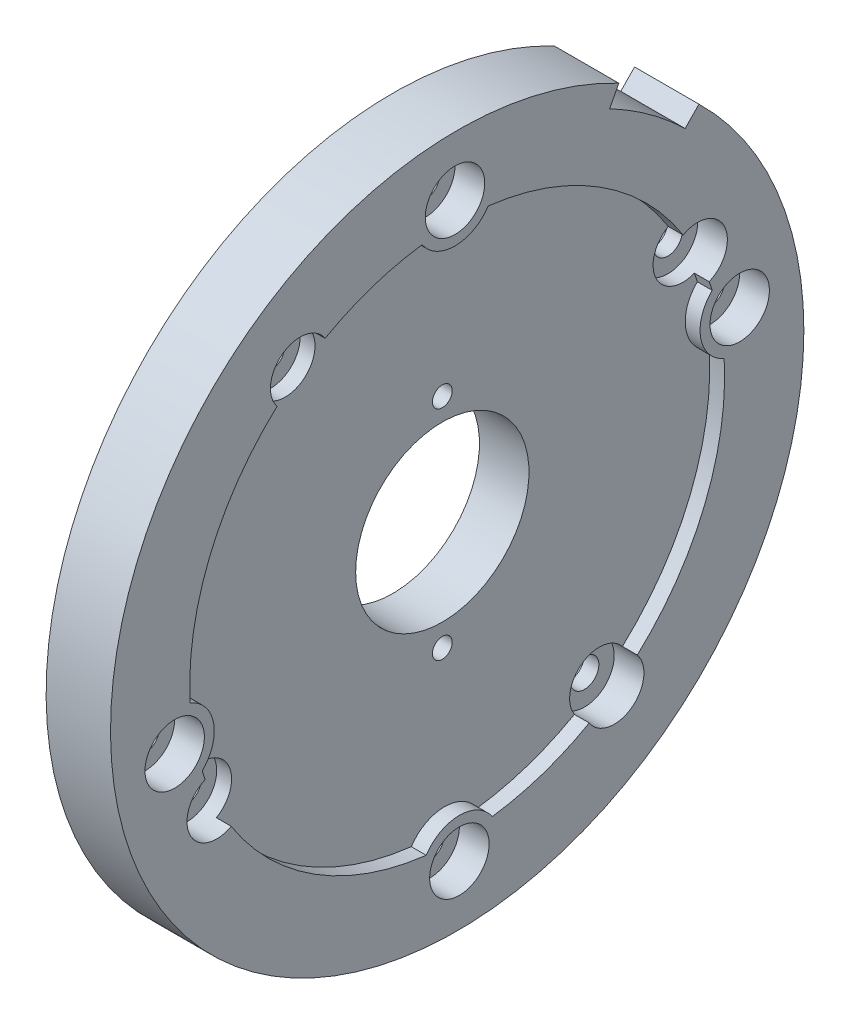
from build123d import *
from build123d.topology import SkipClean

# Parameters (mm, degrees)
ESQUISSE2_R                                       = 2.25
EXTRUSION1_DEPTH                                  = 2.5
R_P_TITION_CIRCULAIRE1_COUNT                      = 2
ESQUISSE3_R                                       = 1
ENL_V_MAT_EXTRU_1_DEPTH                           = 10
CHAMBRAGE_POUR_VIS_T_TE_HEXAGONALE_M2_D           = 2.9
CHAMBRAGE_POUR_VIS_T_TE_HEXAGONALE_M2_CBORE_D     = 5.5
CHAMBRAGE_POUR_VIS_T_TE_HEXAGONALE_M2_CBORE_DEPTH = 2
R_P_TITION_CIRCULAIRE2_COUNT                      = 2
R_P_TITION_CIRCULAIRE2_ANGLE                      = 100
R_P_TITION_CIRCULAIRE3_COUNT                      = 2
R_P_TITION_CIRCULAIRE4_COUNT                      = 2
R_P_TITION_CIRCULAIRE4_ANGLE                      = 280
ESQUISSE7_R                                       = 3
ENL_V_MAT_EXTRU_2_DEPTH                           = 3
CHAMBRAGE_POUR_VIS_T_TE_HEXAGONALE_2_D            = 2.9
CHAMBRAGE_POUR_VIS_T_TE_HEXAGONALE_2_CBORE_D      = 5.5
CHAMBRAGE_POUR_VIS_T_TE_HEXAGONALE_2_CBORE_DEPTH  = 2
R_P_TITION_CIRCULAIRE5_COUNT                      = 2
R_P_TITION_CIRCULAIRE5_ANGLE                      = 80
R_P_TITION_CIRCULAIRE6_COUNT                      = 2
R_P_TITION_CIRCULAIRE6_ANGLE                      = 100
R_P_TITION_CIRCULAIRE7_COUNT                      = 2
ESQUISSE10_R                                      = 3
ENL_V_MAT_EXTRU_3_DEPTH                           = 3
EXTRUSION3_START                                  = -1.5
EXTRUSION3_DEPTH                                  = 1.5
ENL_V_MAT_EXTRU_4_DEPTH                           = 50.922439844


with BuildPart() as part:
    # Esquisse1 → R_volution1 (revolve)
    with BuildSketch(Plane.XY, mode=Mode.PRIVATE) as r_volution1_sk:
        Polygon((0, 8.75), (0, 12), (2.5, 12), (2.5, 24.5), (0, 24.5), (0, 35), (6.5, 35), (6.5, 27), (5, 27), (5, 8.75), align=None)
    revolve(r_volution1_sk.sketch.rotate(Axis((-33.982384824, 0, 0), (1, 0, 0)), 90), axis=Axis((-33.982384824, 0, 0), (1, 0, 0)))

    # Esquisse2 → Extrusion1 (add)
    with BuildSketch(Plane.ZY):
        with Locations((0, 11)):
            Circle(ESQUISSE2_R)
    extrusion1 = extrude(amount=-EXTRUSION1_DEPTH)

    # R_p_tition circulaire1: Extrusion1 ×2 about axis
    r_p_tition_circulaire1_axis = Axis((0, 0, 0), (1, 0, 0))
    for i in range(1, R_P_TITION_CIRCULAIRE1_COUNT):
        add(extrusion1.rotate(r_p_tition_circulaire1_axis, i * 360 / R_P_TITION_CIRCULAIRE1_COUNT))

    # Esquisse3 → Enl_v. mat.-Extru.1 (cut)
    with BuildSketch(Plane.ZY):
        with Locations((0, 11)):
            Circle(ESQUISSE3_R)
        with Locations((0, -11)):
            Circle(ESQUISSE3_R)
    extrude(amount=-ENL_V_MAT_EXTRU_1_DEPTH, mode=Mode.SUBTRACT)

    # Chambrage pour vis _ t_te hexagonale M2 (through all)
    with Locations(Plane(origin=(0, -21.856019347, -15.852899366), x_dir=(0, 0, -1), z_dir=(-1, 0, 0))):
        with Locations((0, 0)):
            chambrage_pour_vis_t_te_hexagonale_m2 = CounterBoreHole(CHAMBRAGE_POUR_VIS_T_TE_HEXAGONALE_M2_D / 2, CHAMBRAGE_POUR_VIS_T_TE_HEXAGONALE_M2_CBORE_D / 2, CHAMBRAGE_POUR_VIS_T_TE_HEXAGONALE_M2_CBORE_DEPTH)

    # R_p_tition circulaire2: Chambrage pour vis _ t_te hexagonale M2 ×2 about axis
    r_p_tition_circulaire2_axis = Axis((0, 0, 0), (-1, 0, 0))
    for i in range(1, R_P_TITION_CIRCULAIRE2_COUNT):
        add(chambrage_pour_vis_t_te_hexagonale_m2.rotate(r_p_tition_circulaire2_axis, i * R_P_TITION_CIRCULAIRE2_ANGLE / (R_P_TITION_CIRCULAIRE2_COUNT - 1)), mode=Mode.SUBTRACT)

    # R_p_tition circulaire3: Chambrage pour vis _ t_te hexagonale M2 ×2 about axis
    r_p_tition_circulaire3_axis = Axis((0, 0, 0), (1, 0, 0))
    for i in range(1, R_P_TITION_CIRCULAIRE3_COUNT):
        add(chambrage_pour_vis_t_te_hexagonale_m2.rotate(r_p_tition_circulaire3_axis, i * 360 / R_P_TITION_CIRCULAIRE3_COUNT), mode=Mode.SUBTRACT)

    # R_p_tition circulaire4: Chambrage pour vis _ t_te hexagonale M2 ×2 about axis
    r_p_tition_circulaire4_axis = Axis((0, 0, 0), (-1, 0, 0))
    for i in range(1, R_P_TITION_CIRCULAIRE4_COUNT):
        add(chambrage_pour_vis_t_te_hexagonale_m2.rotate(r_p_tition_circulaire4_axis, i * R_P_TITION_CIRCULAIRE4_ANGLE / (R_P_TITION_CIRCULAIRE4_COUNT - 1)), mode=Mode.SUBTRACT)

    # Esquisse7 → Enl_v. mat.-Extru.2 (cut)
    with BuildSketch(Plane(origin=(6.5, 0, 0), x_dir=(0, 0, -1), z_dir=(1, 0, 0))):
        with Locations((24.276804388, 11.816800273)):
            Circle(ESQUISSE7_R)
        with Locations((-15.852899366, 21.856019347)):
            Circle(ESQUISSE7_R)
        with Locations((15.852899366, -21.856019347)):
            Circle(ESQUISSE7_R)
        with Locations((-24.276804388, -11.816800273)):
            Circle(ESQUISSE7_R)
    extrude(amount=-ENL_V_MAT_EXTRU_2_DEPTH, mode=Mode.SUBTRACT)

    # Chambrage pour vis _ t_te hexagonale 2 (through all)
    with Locations(Plane.ZY):
        with Locations((0.221751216, 29)):
            chambrage_pour_vis_t_te_hexagonale_2 = CounterBoreHole(CHAMBRAGE_POUR_VIS_T_TE_HEXAGONALE_2_D / 2, CHAMBRAGE_POUR_VIS_T_TE_HEXAGONALE_2_CBORE_D / 2, CHAMBRAGE_POUR_VIS_T_TE_HEXAGONALE_2_CBORE_DEPTH)

    # R_p_tition circulaire5: Chambrage pour vis _ t_te hexagonale 2 ×2 about axis
    r_p_tition_circulaire5_axis = Axis((0, 0, 0), (-1, 0, 0))
    for i in range(1, R_P_TITION_CIRCULAIRE5_COUNT):
        add(chambrage_pour_vis_t_te_hexagonale_2.rotate(r_p_tition_circulaire5_axis, i * R_P_TITION_CIRCULAIRE5_ANGLE / (R_P_TITION_CIRCULAIRE5_COUNT - 1)), mode=Mode.SUBTRACT)

    # R_p_tition circulaire6: Chambrage pour vis _ t_te hexagonale 2 ×2 about axis
    r_p_tition_circulaire6_axis = Axis((0, 0, 0), (1, 0, 0))
    for i in range(1, R_P_TITION_CIRCULAIRE6_COUNT):
        add(chambrage_pour_vis_t_te_hexagonale_2.rotate(r_p_tition_circulaire6_axis, i * R_P_TITION_CIRCULAIRE6_ANGLE / (R_P_TITION_CIRCULAIRE6_COUNT - 1)), mode=Mode.SUBTRACT)

    # R_p_tition circulaire7: Chambrage pour vis _ t_te hexagonale 2 ×2 about axis
    r_p_tition_circulaire7_axis = Axis((0, 0, 0), (1, 0, 0))
    for i in range(1, R_P_TITION_CIRCULAIRE7_COUNT):
        add(chambrage_pour_vis_t_te_hexagonale_2.rotate(r_p_tition_circulaire7_axis, i * 360 / R_P_TITION_CIRCULAIRE7_COUNT), mode=Mode.SUBTRACT)

    # Esquisse10 → Enl_v. mat.-Extru.3 (cut)
    with BuildSketch(Plane(origin=(6.5, 0, 0), x_dir=(0, 0, -1), z_dir=(1, 0, 0))):
        with Locations((-0.221751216, 29)):
            Circle(ESQUISSE10_R)
        with Locations((28.520918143, 5.254179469)):
            Circle(ESQUISSE10_R)
        with Locations((0.221751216, -29)):
            Circle(ESQUISSE10_R)
        with Locations((-28.520918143, -5.254179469)):
            Circle(ESQUISSE10_R)
    extrude(amount=-ENL_V_MAT_EXTRU_3_DEPTH, mode=Mode.SUBTRACT)

    # Esquisse11 → Extrusion3 (add)
    with SkipClean():  # the faces are left unmerged after this step: merging them gives an invalid solid
        with BuildSketch(Plane(origin=(6.5, 0, 0), x_dir=(0, 0, -1), z_dir=(1, 0, 0)).offset(EXTRUSION3_START)):
            with BuildLine():
                ThreePointArc((-25.745453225, -8.134595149), (-24.587113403, -4.529486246), (-26.954092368, -1.573818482))
                ThreePointArc((-26.954092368, -1.573818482), (-26.912999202, -2.165750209), (-26.858908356, -2.756635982))
                ThreePointArc((-26.858908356, -2.756635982), (-25.570564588, -4.710659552), (-26.078015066, -6.995507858))
                ThreePointArc((-26.078015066, -6.995507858), (-25.917992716, -7.566878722), (-25.745453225, -8.134595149))
            make_face()
            with BuildLine():
                ThreePointArc((-3.540361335, 26.766879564), (-0.191165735, 25.000116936), (3.130620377, 26.817889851))
                ThreePointArc((3.130620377, 26.817889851), (2.54054567, 26.880208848), (1.949244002, 26.929546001))
                ThreePointArc((1.949244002, 26.929546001), (-0.198812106, 26.000087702), (-2.360830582, 26.896588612))
                ThreePointArc((-2.360830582, 26.896588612), (-2.951308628, 26.83821487), (-3.540361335, 26.766879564))
            make_face()
            with BuildLine():
                ThreePointArc((25.745453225, 8.134595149), (24.587113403, 4.529486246), (26.954092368, 1.573818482))
                ThreePointArc((26.954092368, 1.573818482), (26.912999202, 2.165750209), (26.858908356, 2.756635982))
                ThreePointArc((26.858908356, 2.756635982), (25.570564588, 4.710659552), (26.078015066, 6.995507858))
                ThreePointArc((26.078015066, 6.995507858), (25.917992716, 7.566878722), (25.745453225, 8.134595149))
            make_face()
            with BuildLine():
                ThreePointArc((3.540361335, -26.766879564), (0.191165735, -25.000116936), (-3.130620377, -26.817889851))
                ThreePointArc((-3.130620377, -26.817889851), (-2.54054567, -26.880208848), (-1.949244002, -26.929546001))
                ThreePointArc((-1.949244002, -26.929546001), (0.198812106, -26.000087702), (2.360830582, -26.896588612))
                ThreePointArc((2.360830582, -26.896588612), (2.951308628, -26.83821487), (3.540361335, -26.766879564))
            make_face()
        extrude(amount=EXTRUSION3_DEPTH)

    # Esquisse12 → Enl_v. mat.-Extru.4 (cut, through all)
    with BuildSketch(Plane(origin=(6.5, 0, 0), x_dir=(0, 0, -1), z_dir=(1, 0, 0))):
        with BuildLine():
            Line((16.316393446, 30.96409703), (15.393103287, 29.189936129))
            ThreePointArc((15.393103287, 29.189936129), (19.4010629, 26.694545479), (23.011902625, 23.652744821))
            Line((23.011902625, 23.652744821), (24.40656339, 25.086244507))
            ThreePointArc((24.40656339, 25.086244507), (20.57248383, 28.315594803), (16.316393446, 30.96409703))
        make_face()
    extrude(amount=-ENL_V_MAT_EXTRU_4_DEPTH, mode=Mode.SUBTRACT)


solid = part.part
